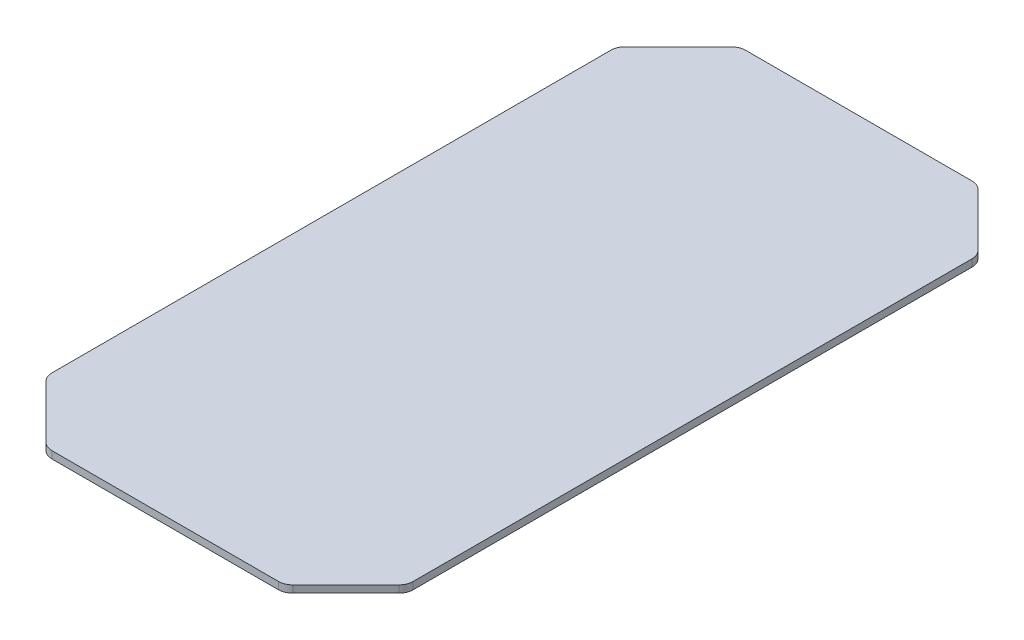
from build123d import *

# Parameters (mm, degrees)
SKETCH1_W           = 317.5
SKETCH1_H           = 609.6
BOSS_EXTRUDE1_DEPTH = 6.35
CHAMFER1_SIZE       = 53.975
FILLET1_R           = 12.7


with BuildPart() as part:
    # Sketch1 → Boss-Extrude1 (new body)
    with BuildSketch(Plane(origin=(0, 0, 0), x_dir=(1, 0, 0), z_dir=(0, 1, 0))):
        Rectangle(SKETCH1_W, SKETCH1_H)
    extrude(amount=BOSS_EXTRUDE1_DEPTH)

    # Chamfer1
    chamfer1_edges = [part.edges().sort_by_distance(p)[0] for p in [
        (158.75, 3.175, 304.8),
        (-158.75, 3.175, 304.8),
        (-158.75, 3.175, -304.8),
        (158.75, 3.175, -304.8),
    ]]
    chamfer(chamfer1_edges, length=CHAMFER1_SIZE)

    # Fillet1
    fillet1_edges = [part.edges().sort_by_distance(p)[0] for p in [
        (158.75, 3.175, -250.825),
        (158.75, 3.175, 250.825),
        (-104.775, 3.175, 304.8),
        (104.775, 3.175, 304.8),
        (-104.775, 3.175, -304.8),
        (104.775, 3.175, -304.8),
        (-158.75, 3.175, 250.825),
        (-158.75, 3.175, -250.825),
    ]]
    fillet(fillet1_edges, radius=FILLET1_R)


solid = part.part
